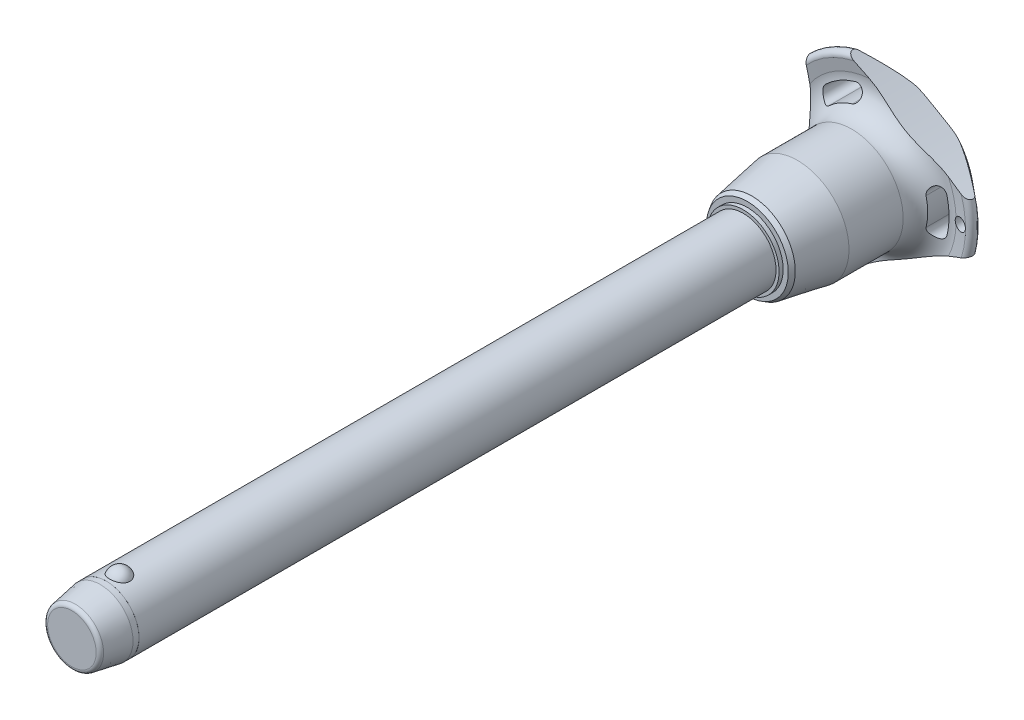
from build123d import *

# Parameters (mm, degrees)
SKETCH1_R           = 8
BOSS_EXTRUDE1_DEPTH = 150
SKETCH2_R           = 7
BOSS_EXTRUDE2_DEPTH = 39.7
BOSS_EXTRUDE3_START = 14
SKETCH1_2_R         = 8
BOSS_EXTRUDE3_DEPTH = 14
CHAMFER1_SIZE       = 7
CHAMFER1_SIZE2      = 1.234288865
FILLET1_R           = 1
SKETCH6_R           = 144.275
CUT_EXTRUDE1_DEPTH  = 193.665775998
CIRPATTERN1_COUNT   = 3
SKETCH7_R           = 1.5
CUT_EXTRUDE2_DEPTH  = 193.561583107
SKETCH8_R           = 8
SKETCH8_R_2         = 7.99
CUT_EXTRUDE3_DEPTH  = 8.4


with BuildPart() as part:
    # Sketch1 → Boss-Extrude1 (new body)
    with BuildSketch(Plane.XY):
        Circle(SKETCH1_R)
    extrude(amount=-BOSS_EXTRUDE1_DEPTH)

    # Sketch2 → Boss-Extrude2 (add)
    with BuildSketch(Plane(origin=(0, 0, -150), x_dir=(-1, 0, 0), z_dir=(0, 0, -1))):
        Circle(SKETCH2_R)
    extrude(amount=BOSS_EXTRUDE2_DEPTH)

    # Sketch3 → Revolve1 (revolve)
    with BuildSketch(Plane(origin=(0, 0, 0), x_dir=(0, 0, -1), z_dir=(1, 0, 0))):
        with BuildLine():
            Line((-2.387467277, 9.5), (-2.387467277, 4.2))
            ThreePointArc((-2.387467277, 4.2), (0.262532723, 6.85), (-2.387467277, 9.5))
        make_face()
        with BuildLine():
            Line((-2.387467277, -4.2), (-2.387467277, -9.5))
            ThreePointArc((-2.387467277, -9.5), (0.262532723, -6.85), (-2.387467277, -4.2))
        make_face()
    revolve(axis=Axis((0, -4.2, 2.387467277), (0, 1, 0)))

    # Sketch1_2 → Boss-Extrude3 (add)
    with BuildSketch(Plane.XY.offset(BOSS_EXTRUDE3_START)):
        Circle(SKETCH1_2_R)
    extrude(amount=-BOSS_EXTRUDE3_DEPTH)

    # Chamfer1
    chamfer1_edges = [part.edges().sort_by_distance(p)[0] for p in [
        (-8, 0, 14),
    ]]
    chamfer1_side = [part.faces().sort_by_distance(p)[0] for p in [
        (-8, 0, -68),
    ]]
    chamfer(chamfer1_edges, length=CHAMFER1_SIZE, length2=CHAMFER1_SIZE2, reference=chamfer1_side[0])

    # Fillet1
    fillet1_edges = [part.edges().sort_by_distance(p)[0] for p in [
        (-6.765711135, 0, 14),
        (7, 0, -189.7),
    ]]
    fillet(fillet1_edges, radius=FILLET1_R)

    # Sketch4 → Revolve2 (revolve)
    with BuildSketch(Plane(origin=(0, 0, 0), x_dir=(0, 0, -1), z_dir=(1, 0, 0)), mode=Mode.PRIVATE) as revolve2_sk:
        Polygon((150, 0), (150, 8.754868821), (151, 8.754868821), (151, 10.007796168), (152.085066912, 10.634259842), (163.233333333, 12.6), (176.466666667, 12.6), (176.466666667, 0), align=None)
    revolve(revolve2_sk.sketch.rotate(Axis((0, 0, -176.466666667), (0, 0, 1)), 90), axis=Axis((0, 0, -176.466666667), (0, 0, 1)))

    # Sketch5 → Revolve3 (revolve)
    with BuildSketch(Plane(origin=(0, 0, 0), x_dir=(0, 0, -1), z_dir=(1, 0, 0)), mode=Mode.PRIVATE) as revolve3_sk:
        with BuildLine():
            Line((182.379459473, 19.619255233), (181.900774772, 22.396148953))
            ThreePointArc((181.900774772, 22.396148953), (182.578274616, 23.688538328), (184.002586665, 23.371345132))
            Line((184.002586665, 23.371345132), (189.141488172, 17.247040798))
            ThreePointArc((189.141488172, 17.247040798), (189.7, 15.584758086), (188.978803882, 13.986322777))
            ThreePointArc((188.978803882, 13.986322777), (184.617427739, 7.589034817), (183.083333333, 0))
            Line((183.083333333, 0), (176.466666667, 0))
            Line((176.466666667, 0), (176.466666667, 12.6))
            ThreePointArc((176.466666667, 12.6), (181.055540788, 14.734481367), (182.379459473, 19.619255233))
        make_face()
    revolve(revolve3_sk.sketch.rotate(Axis((0, 0, -183.083333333), (0, 0, 1)), 90), axis=Axis((0, 0, -183.083333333), (0, 0, 1)))

    # Sketch6 → Cut-Extrude1 (cut, through all)
    with BuildSketch(Plane.XY):
        with Locations((-159.975, 0)):
            Circle(SKETCH6_R)
        with BuildLine():
            ThreePointArc((17.365443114, -4.192809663), (17.864441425, 0), (17.365443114, 4.192809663))
            ThreePointArc((17.365443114, 4.192809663), (15.247788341, 5.486749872), (13.953848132, 3.369095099))
            ThreePointArc((13.953848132, 3.369095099), (14.354813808, 0), (13.953848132, -3.369095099))
            ThreePointArc((13.953848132, -3.369095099), (15.247788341, -5.486749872), (17.365443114, -4.192809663))
        make_face()
    cut_extrude1 = extrude(amount=-CUT_EXTRUDE1_DEPTH, mode=Mode.SUBTRACT)

    # CirPattern1: Cut-Extrude1 ×3 about axis
    cirpattern1_axis = Axis((0, 0, 0), (0, 0, 1))
    for i in range(1, CIRPATTERN1_COUNT):
        add(cut_extrude1.rotate(cirpattern1_axis, i * 360 / CIRPATTERN1_COUNT), mode=Mode.SUBTRACT)

    # Sketch7 → Cut-Extrude2 (cut, through all)
    with BuildSketch(Plane.XY):
        with Locations(Location((20.864441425, 0, 0), (0, 0, 221.008319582))):
            Circle(SKETCH7_R)
    extrude(amount=-CUT_EXTRUDE2_DEPTH, mode=Mode.SUBTRACT)

    # Sketch8 → Cut-Extrude3 (cut)
    with BuildSketch(Plane.XY.offset(14)):
        Circle(SKETCH8_R)
        Circle(SKETCH8_R_2, mode=Mode.SUBTRACT)
    extrude(amount=-CUT_EXTRUDE3_DEPTH, mode=Mode.SUBTRACT)


solid = part.part
